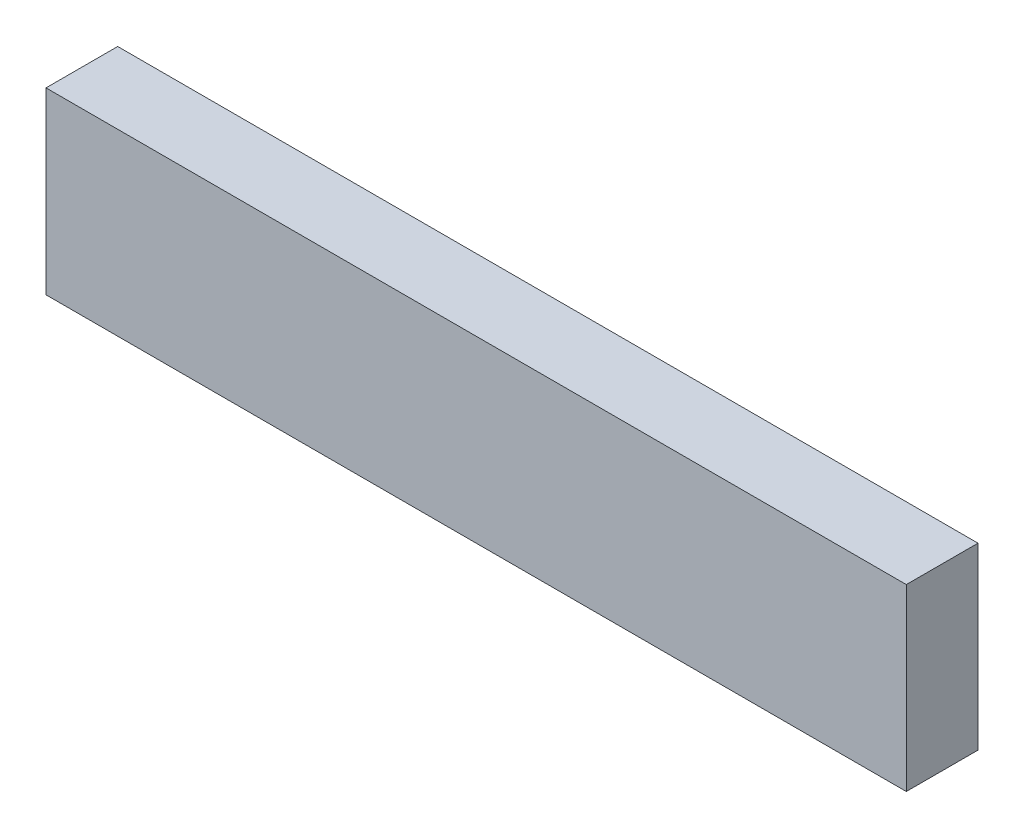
ISO-10303-21;
HEADER;
FILE_DESCRIPTION(('STEP AP214'),'2;1');
FILE_NAME('part.step','',(''),(''),'','','');
FILE_SCHEMA(('AUTOMOTIVE_DESIGN { 1 0 10303 214 1 1 1 1 }'));
ENDSEC;
DATA;
#1=APPLICATION_CONTEXT('core data for automotive mechanical design processes');
#2=APPLICATION_PROTOCOL_DEFINITION('international standard','automotive_design',2000,#1);
#3=PRODUCT_CONTEXT('',#1,'mechanical');
#4=PRODUCT('Part','Part','',(#3));
#5=PRODUCT_RELATED_PRODUCT_CATEGORY('part','',(#4));
#6=PRODUCT_DEFINITION_FORMATION('','',#4);
#7=PRODUCT_DEFINITION_CONTEXT('part definition',#1,'design');
#8=PRODUCT_DEFINITION('design','',#6,#7);
#9=PRODUCT_DEFINITION_SHAPE('','',#8);
#10=(LENGTH_UNIT() NAMED_UNIT(*) SI_UNIT(.MILLI.,.METRE.));
#11=(NAMED_UNIT(*) PLANE_ANGLE_UNIT() SI_UNIT($,.RADIAN.));
#12=(NAMED_UNIT(*) SI_UNIT($,.STERADIAN.) SOLID_ANGLE_UNIT());
#13=UNCERTAINTY_MEASURE_WITH_UNIT(LENGTH_MEASURE(1.E-05),#10,'distance_accuracy_value','');
#14=(GEOMETRIC_REPRESENTATION_CONTEXT(3) GLOBAL_UNCERTAINTY_ASSIGNED_CONTEXT((#13)) GLOBAL_UNIT_ASSIGNED_CONTEXT((#10,
#11,#12)) REPRESENTATION_CONTEXT('',''));
#15=CARTESIAN_POINT('',(0.,0.,0.));
#16=DIRECTION('',(0.,0.,1.));
#17=DIRECTION('',(1.,0.,0.));
#18=AXIS2_PLACEMENT_3D('',#15,#16,#17);
#19=CARTESIAN_POINT('',(0.,0.,12.7));
#20=DIRECTION('',(0.,0.,-1.));
#21=DIRECTION('',(-1.,0.,0.));
#22=AXIS2_PLACEMENT_3D('',#19,#20,#21);
#23=PLANE('',#22);
#24=DIRECTION('',(1.,0.,0.));
#25=VECTOR('',#24,1.);
#26=CARTESIAN_POINT('',(-76.2,15.875,12.7));
#27=LINE('',#26,#25);
#28=CARTESIAN_POINT('',(-76.2,15.875,12.7));
#29=VERTEX_POINT('',#28);
#30=CARTESIAN_POINT('',(76.2,15.875,12.7));
#31=VERTEX_POINT('',#30);
#32=EDGE_CURVE('E66',#29,#31,#27,.T.);
#33=ORIENTED_EDGE('',*,*,#32,.F.);
#34=DIRECTION('',(0.,1.,0.));
#35=VECTOR('',#34,1.);
#36=CARTESIAN_POINT('',(-76.2,-15.875,12.7));
#37=LINE('',#36,#35);
#38=CARTESIAN_POINT('',(-76.2,-15.875,12.7));
#39=VERTEX_POINT('',#38);
#40=EDGE_CURVE('E74',#39,#29,#37,.T.);
#41=ORIENTED_EDGE('',*,*,#40,.F.);
#42=DIRECTION('',(-1.,0.,0.));
#43=VECTOR('',#42,1.);
#44=CARTESIAN_POINT('',(76.2,-15.875,12.7));
#45=LINE('',#44,#43);
#46=CARTESIAN_POINT('',(76.2,-15.875,12.7));
#47=VERTEX_POINT('',#46);
#48=EDGE_CURVE('E68',#47,#39,#45,.T.);
#49=ORIENTED_EDGE('',*,*,#48,.F.);
#50=DIRECTION('',(0.,-1.,0.));
#51=VECTOR('',#50,1.);
#52=CARTESIAN_POINT('',(76.2,15.875,12.7));
#53=LINE('',#52,#51);
#54=EDGE_CURVE('E54',#31,#47,#53,.T.);
#55=ORIENTED_EDGE('',*,*,#54,.F.);
#56=EDGE_LOOP('',(#33,#41,#49,#55));
#57=FACE_BOUND('',#56,.T.);
#58=ADVANCED_FACE('F14',(#57),#23,.F.);
#59=CARTESIAN_POINT('',(76.2,15.875,0.));
#60=DIRECTION('',(1.,0.,0.));
#61=DIRECTION('',(0.,1.,0.));
#62=AXIS2_PLACEMENT_3D('',#59,#60,#61);
#63=PLANE('',#62);
#64=DIRECTION('',(0.,0.,1.));
#65=VECTOR('',#64,1.);
#66=CARTESIAN_POINT('',(76.2,15.875,0.));
#67=LINE('',#66,#65);
#68=CARTESIAN_POINT('',(76.2,15.875,0.));
#69=VERTEX_POINT('',#68);
#70=EDGE_CURVE('E18',#69,#31,#67,.T.);
#71=ORIENTED_EDGE('',*,*,#70,.T.);
#72=ORIENTED_EDGE('',*,*,#54,.T.);
#73=DIRECTION('',(0.,0.,1.));
#74=VECTOR('',#73,1.);
#75=CARTESIAN_POINT('',(76.2,-15.875,0.));
#76=LINE('',#75,#74);
#77=CARTESIAN_POINT('',(76.2,-15.875,0.));
#78=VERTEX_POINT('',#77);
#79=EDGE_CURVE('E9',#78,#47,#76,.T.);
#80=ORIENTED_EDGE('',*,*,#79,.F.);
#81=DIRECTION('',(0.,1.,0.));
#82=VECTOR('',#81,1.);
#83=CARTESIAN_POINT('',(76.2,15.875,0.));
#84=LINE('',#83,#82);
#85=EDGE_CURVE('E55',#78,#69,#84,.T.);
#86=ORIENTED_EDGE('',*,*,#85,.T.);
#87=EDGE_LOOP('',(#71,#72,#80,#86));
#88=FACE_BOUND('',#87,.T.);
#89=ADVANCED_FACE('F16',(#88),#63,.T.);
#90=CARTESIAN_POINT('',(-76.2,-15.875,0.));
#91=DIRECTION('',(0.,-1.,0.));
#92=DIRECTION('',(1.,0.,0.));
#93=AXIS2_PLACEMENT_3D('',#90,#91,#92);
#94=PLANE('',#93);
#95=ORIENTED_EDGE('',*,*,#48,.T.);
#96=DIRECTION('',(0.,0.,1.));
#97=VECTOR('',#96,1.);
#98=CARTESIAN_POINT('',(-76.2,-15.875,0.));
#99=LINE('',#98,#97);
#100=CARTESIAN_POINT('',(-76.2,-15.875,0.));
#101=VERTEX_POINT('',#100);
#102=EDGE_CURVE('E23',#101,#39,#99,.T.);
#103=ORIENTED_EDGE('',*,*,#102,.F.);
#104=DIRECTION('',(1.,0.,0.));
#105=VECTOR('',#104,1.);
#106=CARTESIAN_POINT('',(-76.2,-15.875,0.));
#107=LINE('',#106,#105);
#108=EDGE_CURVE('E61',#101,#78,#107,.T.);
#109=ORIENTED_EDGE('',*,*,#108,.T.);
#110=ORIENTED_EDGE('',*,*,#79,.T.);
#111=EDGE_LOOP('',(#95,#103,#109,#110));
#112=FACE_BOUND('',#111,.T.);
#113=ADVANCED_FACE('F86',(#112),#94,.T.);
#114=CARTESIAN_POINT('',(-76.2,15.875,0.));
#115=DIRECTION('',(-1.,0.,0.));
#116=DIRECTION('',(0.,-1.,0.));
#117=AXIS2_PLACEMENT_3D('',#114,#115,#116);
#118=PLANE('',#117);
#119=ORIENTED_EDGE('',*,*,#102,.T.);
#120=ORIENTED_EDGE('',*,*,#40,.T.);
#121=DIRECTION('',(0.,0.,1.));
#122=VECTOR('',#121,1.);
#123=CARTESIAN_POINT('',(-76.2,15.875,0.));
#124=LINE('',#123,#122);
#125=CARTESIAN_POINT('',(-76.2,15.875,0.));
#126=VERTEX_POINT('',#125);
#127=EDGE_CURVE('E60',#126,#29,#124,.T.);
#128=ORIENTED_EDGE('',*,*,#127,.F.);
#129=DIRECTION('',(0.,-1.,0.));
#130=VECTOR('',#129,1.);
#131=CARTESIAN_POINT('',(-76.2,15.875,0.));
#132=LINE('',#131,#130);
#133=EDGE_CURVE('E79',#126,#101,#132,.T.);
#134=ORIENTED_EDGE('',*,*,#133,.T.);
#135=EDGE_LOOP('',(#119,#120,#128,#134));
#136=FACE_BOUND('',#135,.T.);
#137=ADVANCED_FACE('F83',(#136),#118,.T.);
#138=CARTESIAN_POINT('',(-76.2,15.875,0.));
#139=DIRECTION('',(0.,1.,0.));
#140=DIRECTION('',(-1.,0.,0.));
#141=AXIS2_PLACEMENT_3D('',#138,#139,#140);
#142=PLANE('',#141);
#143=ORIENTED_EDGE('',*,*,#32,.T.);
#144=ORIENTED_EDGE('',*,*,#70,.F.);
#145=DIRECTION('',(-1.,0.,0.));
#146=VECTOR('',#145,1.);
#147=CARTESIAN_POINT('',(-76.2,15.875,0.));
#148=LINE('',#147,#146);
#149=EDGE_CURVE('E77',#69,#126,#148,.T.);
#150=ORIENTED_EDGE('',*,*,#149,.T.);
#151=ORIENTED_EDGE('',*,*,#127,.T.);
#152=EDGE_LOOP('',(#143,#144,#150,#151));
#153=FACE_BOUND('',#152,.T.);
#154=ADVANCED_FACE('F70',(#153),#142,.T.);
#155=CARTESIAN_POINT('',(0.,0.,0.));
#156=DIRECTION('',(0.,0.,1.));
#157=DIRECTION('',(0.,-1.,0.));
#158=AXIS2_PLACEMENT_3D('',#155,#156,#157);
#159=PLANE('',#158);
#160=ORIENTED_EDGE('',*,*,#85,.F.);
#161=ORIENTED_EDGE('',*,*,#108,.F.);
#162=ORIENTED_EDGE('',*,*,#133,.F.);
#163=ORIENTED_EDGE('',*,*,#149,.F.);
#164=EDGE_LOOP('',(#160,#161,#162,#163));
#165=FACE_BOUND('',#164,.T.);
#166=ADVANCED_FACE('F88',(#165),#159,.F.);
#167=CLOSED_SHELL('',(#58,#89,#113,#137,#154,#166));
#168=MANIFOLD_SOLID_BREP('B1',#167);
#169=ADVANCED_BREP_SHAPE_REPRESENTATION('',(#18,#168),#14);
#170=SHAPE_DEFINITION_REPRESENTATION(#9,#169);
ENDSEC;
END-ISO-10303-21;
